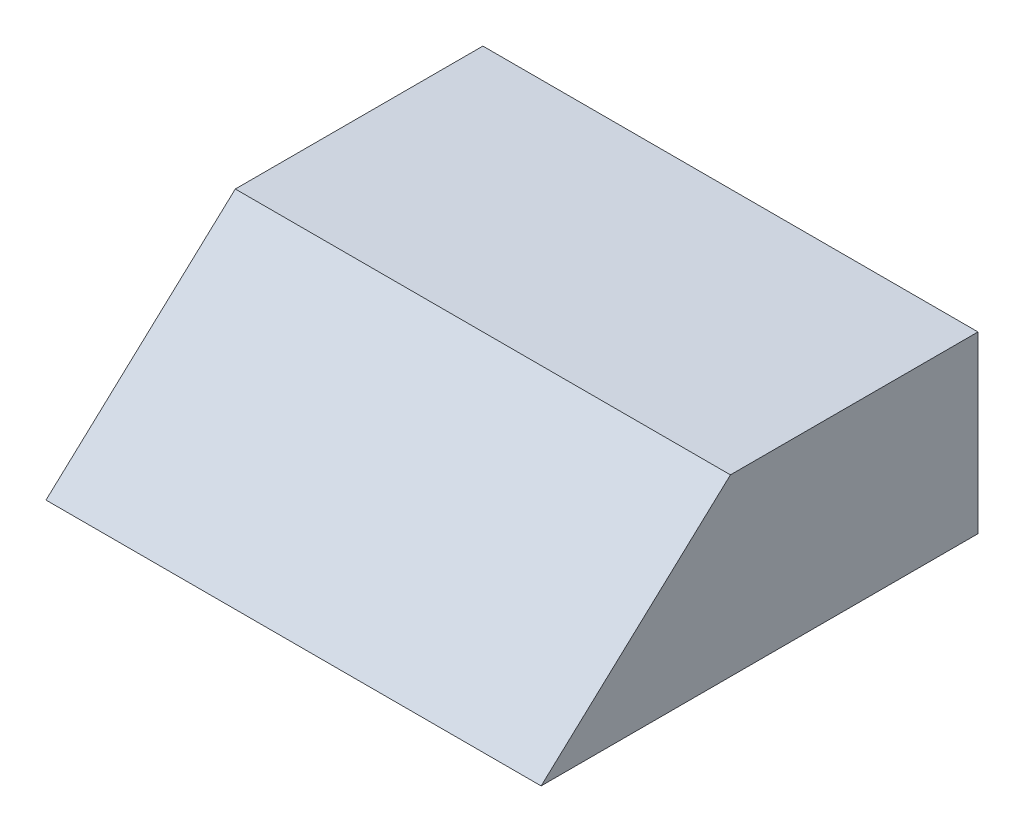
from build123d import *

# Parameters (mm, degrees)
VISEUR_DEPTH = 17


with BuildPart() as part:
    # Esquisse1 → viseur (new, symmetric)
    with BuildSketch(Plane(origin=(0, 0, 0), x_dir=(0, 0, -1), z_dir=(1, 0, 0))):
        Polygon((0, 0), (30, 0), (30, 12), (13, 12), align=None)
    extrude(amount=VISEUR_DEPTH, both=True)


solid = part.part
